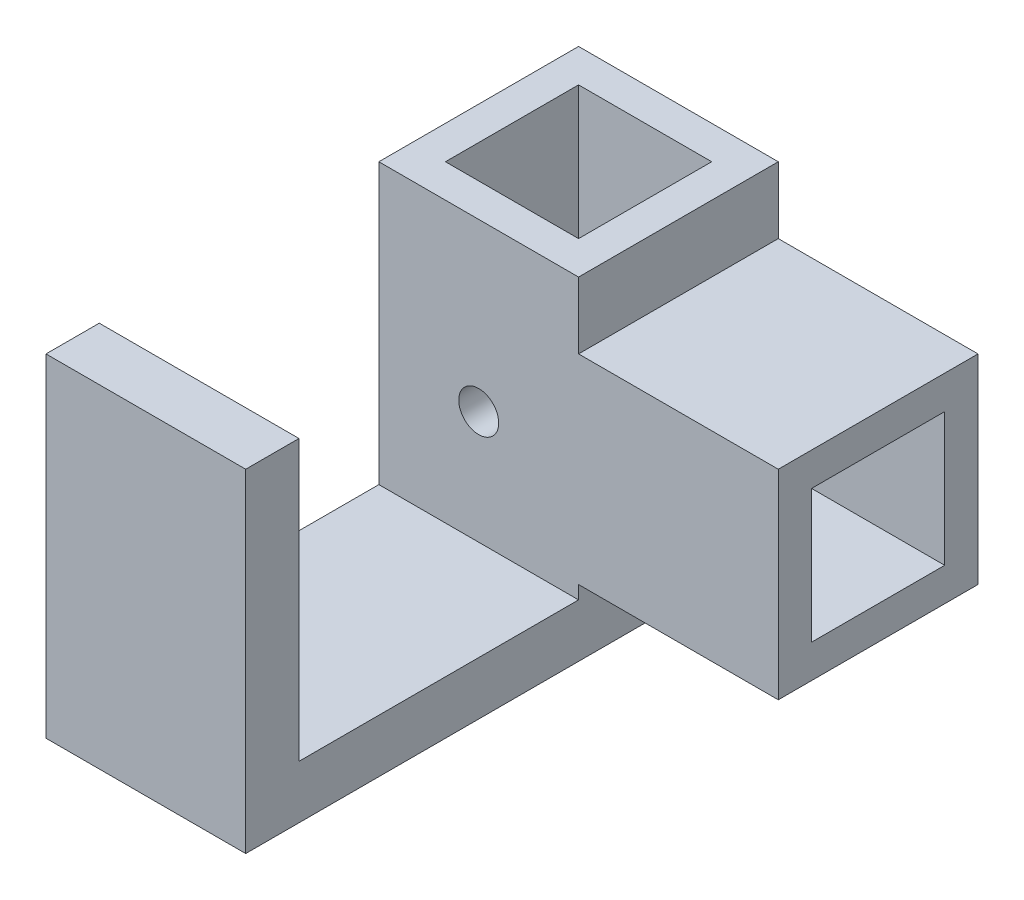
from build123d import *

# Parameters (mm, degrees)
SKETCH1_R                = 3
BOSS_EXTRUDE1_DEPTH      = 15
SKETCH2_W                = 20
SKETCH2_H                = 20
CUT_EXTRUDE1_DEPTH       = 59
SKETCH3_W                = 20
SKETCH3_H                = 20
CUT_EXTRUDE2_DEPTH       = 25
BOSS_EXTRUDE2_DEPTH      = 25
BOSS_EXTRUDE2_DEPTH_BACK = 5


with BuildPart() as part:
    # Sketch1 → Boss-Extrude1 (new, symmetric)
    with BuildSketch(Plane.XY):
        Polygon((15, 15), (15, 25), (-15, 25), (-15, -25), (15, -25), (15, -15), (45, -15), (45, 15), align=None)
        Circle(SKETCH1_R, mode=Mode.SUBTRACT)
    extrude(amount=BOSS_EXTRUDE1_DEPTH, both=True)

    # Sketch2 → Cut-Extrude1 (cut)
    with BuildSketch(Plane(origin=(0, 25, 0), x_dir=(1, 0, 0), z_dir=(0, 1, 0))):
        Rectangle(SKETCH2_W, SKETCH2_H)
    extrude(amount=-CUT_EXTRUDE1_DEPTH, mode=Mode.SUBTRACT)

    # Sketch3 → Cut-Extrude2 (cut)
    with BuildSketch(Plane(origin=(45, 0, 0), x_dir=(0, 0, -1), z_dir=(1, 0, 0))):
        Rectangle(SKETCH3_W, SKETCH3_H)
    extrude(amount=-CUT_EXTRUDE2_DEPTH, mode=Mode.SUBTRACT)

    # Sketch4 → Boss-Extrude2 (add, two sides: drawn at the far end of the back side and taken through both)
    with BuildSketch(Plane(origin=(-10, 0, 0), x_dir=(0, 0, -1), z_dir=(1, 0, 0)).offset(-BOSS_EXTRUDE2_DEPTH_BACK)):
        Polygon((-57, 25), (-65, 25), (-65, -25), (-15, -25), (-15, -17), (-57, -17), align=None)
    extrude(amount=BOSS_EXTRUDE2_DEPTH + BOSS_EXTRUDE2_DEPTH_BACK)


solid = part.part
